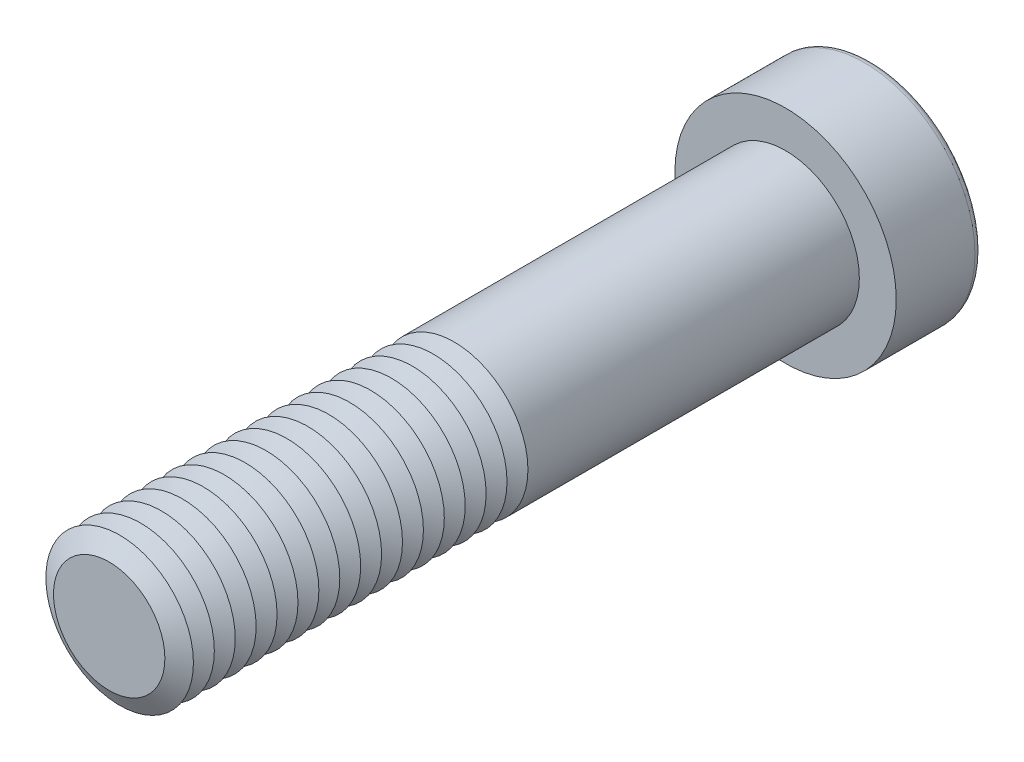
from build123d import *

# Parameters (mm, degrees)
SKETCH1_R           = 6
BOSS_EXTRUDE1_DEPTH = 55
SKETCH2_R           = 9
BOSS_EXTRUDE2_DEPTH = 7
CUT_EXTRUDE1_DEPTH  = 6
FILLET1_R           = 0.6
LPATTERN1_COUNT     = 17
LPATTERN1_PITCH     = 1.7


with BuildPart() as part:
    # Sketch1 → Boss-Extrude1 (new body)
    with BuildSketch(Plane.XY):
        Circle(SKETCH1_R)
    extrude(amount=BOSS_EXTRUDE1_DEPTH)

    # Sketch2 → Boss-Extrude2 (add)
    with BuildSketch(Plane(origin=(0, 0, 0), x_dir=(-1, 0, 0), z_dir=(0, 0, -1))):
        Circle(SKETCH2_R)
    extrude(amount=BOSS_EXTRUDE2_DEPTH)

    # Sketch3 → Cut-Extrude1 (cut)
    with BuildSketch(Plane(origin=(0, 0, -7), x_dir=(-1, 0, 0), z_dir=(0, 0, -1))):
        Polygon((-2.309401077, 4), (-4.618802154, 0), (-2.309401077, -4), (2.309401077, -4), (4.618802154, 0), (2.309401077, 4), align=None)
    extrude(amount=-CUT_EXTRUDE1_DEPTH, mode=Mode.SUBTRACT)

    # Fillet1
    fillet1_edges = [part.edges().sort_by_distance(p)[0] for p in [
        (9, 0, -7),
    ]]
    fillet(fillet1_edges, radius=FILLET1_R)

    # Cut-Extrude2 cone 1 section (on through the dimple's axis) → Cut-Extrude2 (revolve, cut)
    with BuildSketch(Plane(origin=(0, 0, -1), x_dir=(0, 1, 0), z_dir=(1, 0, 0))):
        Polygon((0, 0), (4, 0), (0, 2.309401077), align=None)
    revolve(axis=Axis((0, 0, -1), (0, 0, 1)), mode=Mode.SUBTRACT)

    # Cut-Extrude3 cone 1 section (on through the dimple's axis) → Cut-Extrude3 (revolve, cut)
    with BuildSketch(Plane(origin=(0, 0, -7), x_dir=(0, 1, 0), z_dir=(1, 0, 0))):
        Polygon((0, 0), (4.618802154, 0), (0, 1.237604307), align=None)
    revolve(axis=Axis((0, 0, -7), (0, 0, 1)), mode=Mode.SUBTRACT)

    # Sketch7 → Cut-Revolve1 (revolve, cut)
    with BuildSketch(Plane(origin=(0, 0, 0), x_dir=(0, 0, -1), z_dir=(1, 0, 0)), mode=Mode.PRIVATE) as cut_revolve1_sk:
        Polygon((-55, 4.527756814), (-54.15, 6), (-55.85, 6), align=None)
    cut_revolve1 = revolve(cut_revolve1_sk.sketch.rotate(Axis((0, 0, 55), (0, 0, -1)), 90), axis=Axis((0, 0, 55), (0, 0, -1)), mode=Mode.SUBTRACT)

    # LPattern1: Cut-Revolve1 ×17
    with Locations(*[(0, 0, -i * LPATTERN1_PITCH) for i in range(1, LPATTERN1_COUNT)]):
        add(cut_revolve1, mode=Mode.SUBTRACT)


solid = part.part
